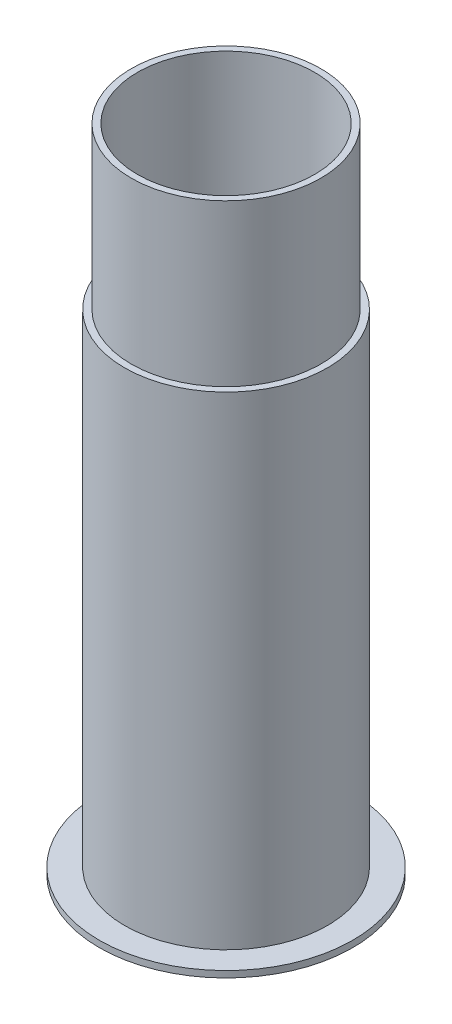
ISO-10303-21;
HEADER;
FILE_DESCRIPTION(('STEP AP214'),'2;1');
FILE_NAME('part.step','',(''),(''),'','','');
FILE_SCHEMA(('AUTOMOTIVE_DESIGN { 1 0 10303 214 1 1 1 1 }'));
ENDSEC;
DATA;
#1=APPLICATION_CONTEXT('core data for automotive mechanical design processes');
#2=APPLICATION_PROTOCOL_DEFINITION('international standard','automotive_design',2000,#1);
#3=PRODUCT_CONTEXT('',#1,'mechanical');
#4=PRODUCT('Part','Part','',(#3));
#5=PRODUCT_RELATED_PRODUCT_CATEGORY('part','',(#4));
#6=PRODUCT_DEFINITION_FORMATION('','',#4);
#7=PRODUCT_DEFINITION_CONTEXT('part definition',#1,'design');
#8=PRODUCT_DEFINITION('design','',#6,#7);
#9=PRODUCT_DEFINITION_SHAPE('','',#8);
#10=(LENGTH_UNIT() NAMED_UNIT(*) SI_UNIT(.MILLI.,.METRE.));
#11=(NAMED_UNIT(*) PLANE_ANGLE_UNIT() SI_UNIT($,.RADIAN.));
#12=(NAMED_UNIT(*) SI_UNIT($,.STERADIAN.) SOLID_ANGLE_UNIT());
#13=UNCERTAINTY_MEASURE_WITH_UNIT(LENGTH_MEASURE(1.E-05),#10,'distance_accuracy_value','');
#14=(GEOMETRIC_REPRESENTATION_CONTEXT(3) GLOBAL_UNCERTAINTY_ASSIGNED_CONTEXT((#13)) GLOBAL_UNIT_ASSIGNED_CONTEXT((#10,
#11,#12)) REPRESENTATION_CONTEXT('',''));
#15=CARTESIAN_POINT('',(0.,0.,0.));
#16=DIRECTION('',(0.,0.,1.));
#17=DIRECTION('',(1.,0.,0.));
#18=AXIS2_PLACEMENT_3D('',#15,#16,#17);
#19=CARTESIAN_POINT('',(0.,19.304,0.));
#20=DIRECTION('',(0.,1.,0.));
#21=DIRECTION('',(0.,0.,1.));
#22=AXIS2_PLACEMENT_3D('',#19,#20,#21);
#23=PLANE('',#22);
#24=CARTESIAN_POINT('',(0.,19.304,0.));
#25=DIRECTION('',(0.,1.,0.));
#26=DIRECTION('',(0.,0.,1.));
#27=AXIS2_PLACEMENT_3D('',#24,#25,#26);
#28=CIRCLE('',#27,4.);
#29=CARTESIAN_POINT('',(0.,19.304,4.));
#30=VERTEX_POINT('',#29);
#31=EDGE_CURVE('E39',#30,#30,#28,.T.);
#32=ORIENTED_EDGE('',*,*,#31,.T.);
#33=EDGE_LOOP('',(#32));
#34=FACE_BOUND('',#33,.T.);
#35=CARTESIAN_POINT('',(0.,19.304,0.));
#36=DIRECTION('',(0.,1.,0.));
#37=DIRECTION('',(0.,0.,1.));
#38=AXIS2_PLACEMENT_3D('',#35,#36,#37);
#39=CIRCLE('',#38,3.741000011);
#40=CARTESIAN_POINT('',(0.,19.304,3.741000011));
#41=VERTEX_POINT('',#40);
#42=EDGE_CURVE('E47',#41,#41,#39,.T.);
#43=ORIENTED_EDGE('',*,*,#42,.F.);
#44=EDGE_LOOP('',(#43));
#45=FACE_BOUND('',#44,.T.);
#46=ADVANCED_FACE('F28',(#34,#45),#23,.T.);
#47=CARTESIAN_POINT('',(0.,0.254,0.));
#48=DIRECTION('',(0.,1.,0.));
#49=DIRECTION('',(0.,0.,1.));
#50=AXIS2_PLACEMENT_3D('',#47,#48,#49);
#51=PLANE('',#50);
#52=CARTESIAN_POINT('',(0.,0.254,0.));
#53=DIRECTION('',(0.,1.,0.));
#54=DIRECTION('',(0.,0.,1.));
#55=AXIS2_PLACEMENT_3D('',#52,#53,#54);
#56=CIRCLE('',#55,5.);
#57=CARTESIAN_POINT('',(0.,0.254,5.));
#58=VERTEX_POINT('',#57);
#59=EDGE_CURVE('E10',#58,#58,#56,.T.);
#60=ORIENTED_EDGE('',*,*,#59,.T.);
#61=EDGE_LOOP('',(#60));
#62=FACE_BOUND('',#61,.T.);
#63=CARTESIAN_POINT('',(0.,0.254,0.));
#64=DIRECTION('',(0.,1.,0.));
#65=DIRECTION('',(0.,0.,1.));
#66=AXIS2_PLACEMENT_3D('',#63,#64,#65);
#67=CIRCLE('',#66,4.);
#68=CARTESIAN_POINT('',(0.,0.254,4.));
#69=VERTEX_POINT('',#68);
#70=EDGE_CURVE('E41',#69,#69,#67,.T.);
#71=ORIENTED_EDGE('',*,*,#70,.F.);
#72=EDGE_LOOP('',(#71));
#73=FACE_BOUND('',#72,.T.);
#74=ADVANCED_FACE('F82',(#62,#73),#51,.T.);
#75=CARTESIAN_POINT('',(0.,0.254,0.));
#76=DIRECTION('',(0.,-1.,0.));
#77=DIRECTION('',(0.,0.,-1.));
#78=AXIS2_PLACEMENT_3D('',#75,#76,#77);
#79=CYLINDRICAL_SURFACE('',#78,5.);
#80=ORIENTED_EDGE('',*,*,#59,.F.);
#81=EDGE_LOOP('',(#80));
#82=FACE_BOUND('',#81,.T.);
#83=CARTESIAN_POINT('',(0.,0.,0.));
#84=DIRECTION('',(0.,1.,0.));
#85=DIRECTION('',(0.,0.,1.));
#86=AXIS2_PLACEMENT_3D('',#83,#84,#85);
#87=CIRCLE('',#86,5.);
#88=CARTESIAN_POINT('',(0.,0.,5.));
#89=VERTEX_POINT('',#88);
#90=EDGE_CURVE('E32',#89,#89,#87,.T.);
#91=ORIENTED_EDGE('',*,*,#90,.T.);
#92=EDGE_LOOP('',(#91));
#93=FACE_BOUND('',#92,.T.);
#94=ADVANCED_FACE('F30',(#82,#93),#79,.T.);
#95=CARTESIAN_POINT('',(0.,0.,0.));
#96=DIRECTION('',(0.,1.,0.));
#97=DIRECTION('',(0.,0.,1.));
#98=AXIS2_PLACEMENT_3D('',#95,#96,#97);
#99=PLANE('',#98);
#100=CARTESIAN_POINT('',(0.,0.,0.));
#101=DIRECTION('',(0.,1.,0.));
#102=DIRECTION('',(0.,0.,1.));
#103=AXIS2_PLACEMENT_3D('',#100,#101,#102);
#104=CIRCLE('',#103,3.4925);
#105=CARTESIAN_POINT('',(0.,0.,3.4925));
#106=VERTEX_POINT('',#105);
#107=EDGE_CURVE('E50',#106,#106,#104,.T.);
#108=ORIENTED_EDGE('',*,*,#107,.T.);
#109=EDGE_LOOP('',(#108));
#110=FACE_BOUND('',#109,.T.);
#111=ORIENTED_EDGE('',*,*,#90,.F.);
#112=EDGE_LOOP('',(#111));
#113=FACE_BOUND('',#112,.T.);
#114=ADVANCED_FACE('F59',(#110,#113),#99,.F.);
#115=CARTESIAN_POINT('',(0.,19.304,0.));
#116=DIRECTION('',(0.,-1.,0.));
#117=DIRECTION('',(0.,0.,-1.));
#118=AXIS2_PLACEMENT_3D('',#115,#116,#117);
#119=CYLINDRICAL_SURFACE('',#118,4.);
#120=ORIENTED_EDGE('',*,*,#31,.F.);
#121=EDGE_LOOP('',(#120));
#122=FACE_BOUND('',#121,.T.);
#123=ORIENTED_EDGE('',*,*,#70,.T.);
#124=EDGE_LOOP('',(#123));
#125=FACE_BOUND('',#124,.T.);
#126=ADVANCED_FACE('F77',(#122,#125),#119,.T.);
#127=CARTESIAN_POINT('',(0.,25.654,0.));
#128=DIRECTION('',(0.,-1.,0.));
#129=DIRECTION('',(0.,0.,-1.));
#130=AXIS2_PLACEMENT_3D('',#127,#128,#129);
#131=CYLINDRICAL_SURFACE('',#130,3.741000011);
#132=CARTESIAN_POINT('',(0.,25.654,0.));
#133=DIRECTION('',(0.,1.,0.));
#134=DIRECTION('',(0.,0.,1.));
#135=AXIS2_PLACEMENT_3D('',#132,#133,#134);
#136=CIRCLE('',#135,3.741000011);
#137=CARTESIAN_POINT('',(0.,25.654,3.741000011));
#138=VERTEX_POINT('',#137);
#139=EDGE_CURVE('E44',#138,#138,#136,.T.);
#140=ORIENTED_EDGE('',*,*,#139,.F.);
#141=EDGE_LOOP('',(#140));
#142=FACE_BOUND('',#141,.T.);
#143=ORIENTED_EDGE('',*,*,#42,.T.);
#144=EDGE_LOOP('',(#143));
#145=FACE_BOUND('',#144,.T.);
#146=ADVANCED_FACE('F71',(#142,#145),#131,.T.);
#147=CARTESIAN_POINT('',(0.,25.654,0.));
#148=DIRECTION('',(0.,1.,0.));
#149=DIRECTION('',(0.,0.,1.));
#150=AXIS2_PLACEMENT_3D('',#147,#148,#149);
#151=PLANE('',#150);
#152=CARTESIAN_POINT('',(0.,25.654,0.));
#153=DIRECTION('',(0.,1.,0.));
#154=DIRECTION('',(0.,0.,1.));
#155=AXIS2_PLACEMENT_3D('',#152,#153,#154);
#156=CIRCLE('',#155,3.4925);
#157=CARTESIAN_POINT('',(0.,25.654,3.4925));
#158=VERTEX_POINT('',#157);
#159=EDGE_CURVE('E53',#158,#158,#156,.T.);
#160=ORIENTED_EDGE('',*,*,#159,.F.);
#161=EDGE_LOOP('',(#160));
#162=FACE_BOUND('',#161,.T.);
#163=ORIENTED_EDGE('',*,*,#139,.T.);
#164=EDGE_LOOP('',(#163));
#165=FACE_BOUND('',#164,.T.);
#166=ADVANCED_FACE('F65',(#162,#165),#151,.T.);
#167=CARTESIAN_POINT('',(0.,0.,0.));
#168=DIRECTION('',(0.,1.,0.));
#169=DIRECTION('',(0.,0.,1.));
#170=AXIS2_PLACEMENT_3D('',#167,#168,#169);
#171=CYLINDRICAL_SURFACE('',#170,3.4925);
#172=ORIENTED_EDGE('',*,*,#107,.F.);
#173=EDGE_LOOP('',(#172));
#174=FACE_BOUND('',#173,.T.);
#175=ORIENTED_EDGE('',*,*,#159,.T.);
#176=EDGE_LOOP('',(#175));
#177=FACE_BOUND('',#176,.T.);
#178=ADVANCED_FACE('F62',(#174,#177),#171,.F.);
#179=CLOSED_SHELL('',(#46,#74,#94,#114,#126,#146,#166,#178));
#180=MANIFOLD_SOLID_BREP('B2',#179);
#181=ADVANCED_BREP_SHAPE_REPRESENTATION('',(#18,#180),#14);
#182=SHAPE_DEFINITION_REPRESENTATION(#9,#181);
ENDSEC;
END-ISO-10303-21;
